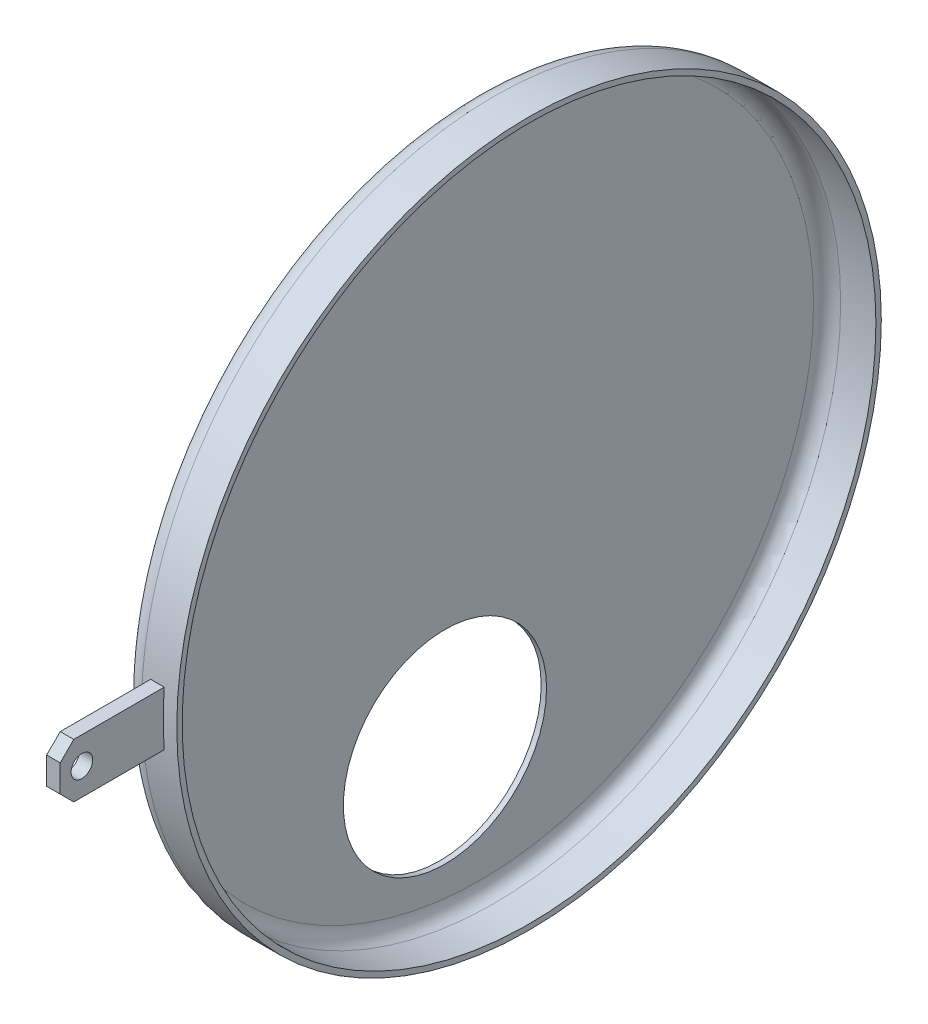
from build123d import *

# Parameters (mm, degrees)
ENL_V_MAT_EXTRU_1_REACH = 193.06
ESQUISSE3_R             = 37.5
BOSS_EXTRU_1_REACH      = 334.572
BOSS_EXTRU_1_END_RADIUS = 130
ESQUISSE4_W             = 5
ESQUISSE4_H             = 20
ESQUISSE5_R             = 4
ENL_V_MAT_EXTRU_2_DEPTH = 223.146348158
CHANFREIN1_SIZE         = 5


with BuildPart() as part:
    # Esquisse1 → Base-R_volution (revolve)
    with BuildSketch(Plane.XY, mode=Mode.PRIVATE) as base_r_volution_sk:
        with BuildLine():
            Line((0, 0), (52, 0))
            Line((52, 0), (52, 123))
            ThreePointArc((52, 123), (53.464466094, 126.535533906), (57, 128))
            Line((57, 128), (70, 128))
            Line((70, 128), (70, 130))
            Line((70, 130), (57, 130))
            ThreePointArc((57, 130), (52.050252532, 127.949747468), (50, 123))
            Line((50, 123), (50, 10))
            Line((50, 10), (0, 10))
            Line((0, 10), (0, 0))
        make_face()
    revolve(base_r_volution_sk.sketch.rotate(Axis((52, 0, 0), (-1, 0, 0)), 90), axis=Axis((52, 0, 0), (-1, 0, 0)))

    # Esquisse3 → Enl_v. mat.-Extru.1 (cut, up to next)
    with BuildSketch(Plane(origin=(52, 0, 0), x_dir=(0, 0, -1), z_dir=(1, 0, 0)), mode=Mode.PRIVATE) as enl_v_mat_extru_1_sk1:
        with Locations((-13.023613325, -73.860581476)):
            Circle(ESQUISSE3_R)
    enl_v_mat_extru_1_tool1 = extrude(enl_v_mat_extru_1_sk1.sketch, amount=-ENL_V_MAT_EXTRU_1_REACH, mode=Mode.PRIVATE) & part.part
    add(enl_v_mat_extru_1_tool1.solids().sort_by_distance((52, -73.860581, 13.023613))[0], mode=Mode.SUBTRACT)

    # Boss.-Extru.1: up to this cylinder (the profile starts outside it)
    boss_extru_1_end = Plane(origin=(62.5, 0, 0), z_dir=(1, 0, 0)) * Cylinder(BOSS_EXTRU_1_END_RADIUS, 930.144, mode=Mode.PRIVATE)
    # Esquisse4 → Boss.-Extru.1 (add, up to the surface)
    with BuildSketch(Plane.XY.offset(168), mode=Mode.PRIVATE) as boss_extru_1_sk1:
        with Locations((62.5, 0)):
            Rectangle(ESQUISSE4_W, ESQUISSE4_H)
    boss_extru_1_tool1 = extrude(boss_extru_1_sk1.sketch, amount=-BOSS_EXTRU_1_REACH, mode=Mode.PRIVATE) - boss_extru_1_end
    add(boss_extru_1_tool1.solids().sort_by_distance((62.5, 0, 168))[0])

    # Esquisse5 → Enl_v. mat.-Extru.2 (cut, through all)
    with BuildSketch(Plane(origin=(65, 0, 0), x_dir=(0, 0, -1), z_dir=(1, 0, 0))):
        with Locations((-160, 0)):
            Circle(ESQUISSE5_R)
    extrude(amount=-ENL_V_MAT_EXTRU_2_DEPTH, mode=Mode.SUBTRACT)

    # Chanfrein1
    chanfrein1_edges = [part.edges().sort_by_distance(p)[0] for p in [
        (62.5, 10, 168),
        (62.5, -10, 168),
    ]]
    chamfer(chanfrein1_edges, length=CHANFREIN1_SIZE)


solid = part.part
